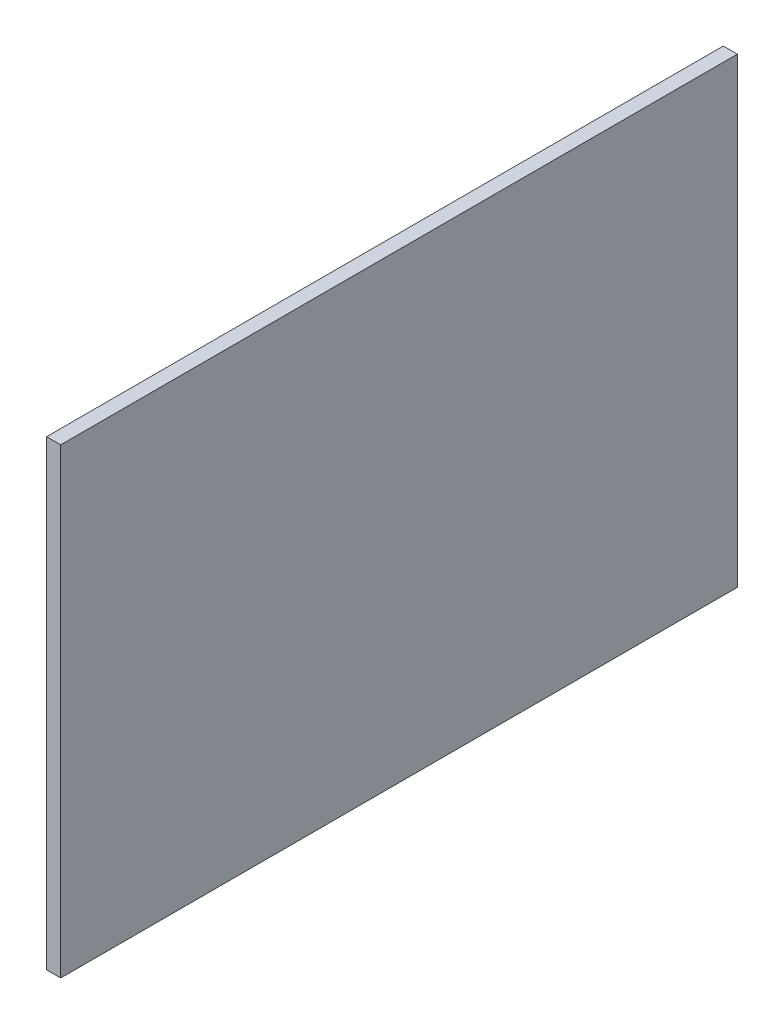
ISO-10303-21;
HEADER;
FILE_DESCRIPTION(('STEP AP214'),'2;1');
FILE_NAME('part.step','',(''),(''),'','','');
FILE_SCHEMA(('AUTOMOTIVE_DESIGN { 1 0 10303 214 1 1 1 1 }'));
ENDSEC;
DATA;
#1=APPLICATION_CONTEXT('core data for automotive mechanical design processes');
#2=APPLICATION_PROTOCOL_DEFINITION('international standard','automotive_design',2000,#1);
#3=PRODUCT_CONTEXT('',#1,'mechanical');
#4=PRODUCT('Part','Part','',(#3));
#5=PRODUCT_RELATED_PRODUCT_CATEGORY('part','',(#4));
#6=PRODUCT_DEFINITION_FORMATION('','',#4);
#7=PRODUCT_DEFINITION_CONTEXT('part definition',#1,'design');
#8=PRODUCT_DEFINITION('design','',#6,#7);
#9=PRODUCT_DEFINITION_SHAPE('','',#8);
#10=(LENGTH_UNIT() NAMED_UNIT(*) SI_UNIT(.MILLI.,.METRE.));
#11=(NAMED_UNIT(*) PLANE_ANGLE_UNIT() SI_UNIT($,.RADIAN.));
#12=(NAMED_UNIT(*) SI_UNIT($,.STERADIAN.) SOLID_ANGLE_UNIT());
#13=UNCERTAINTY_MEASURE_WITH_UNIT(LENGTH_MEASURE(1.E-05),#10,'distance_accuracy_value','');
#14=(GEOMETRIC_REPRESENTATION_CONTEXT(3) GLOBAL_UNCERTAINTY_ASSIGNED_CONTEXT((#13)) GLOBAL_UNIT_ASSIGNED_CONTEXT((#10,
#11,#12)) REPRESENTATION_CONTEXT('',''));
#15=CARTESIAN_POINT('',(0.,0.,0.));
#16=DIRECTION('',(0.,0.,1.));
#17=DIRECTION('',(1.,0.,0.));
#18=AXIS2_PLACEMENT_3D('',#15,#16,#17);
#19=CARTESIAN_POINT('',(0.,831.85,0.));
#20=DIRECTION('',(1.,0.,0.));
#21=DIRECTION('',(0.,0.,-1.));
#22=AXIS2_PLACEMENT_3D('',#19,#20,#21);
#23=PLANE('',#22);
#24=DIRECTION('',(0.,0.,1.));
#25=VECTOR('',#24,1.);
#26=CARTESIAN_POINT('',(0.,0.,0.));
#27=LINE('',#26,#25);
#28=CARTESIAN_POINT('',(0.,0.,-1219.2));
#29=VERTEX_POINT('',#28);
#30=CARTESIAN_POINT('',(0.,0.,0.));
#31=VERTEX_POINT('',#30);
#32=EDGE_CURVE('E95',#29,#31,#27,.T.);
#33=ORIENTED_EDGE('',*,*,#32,.T.);
#34=DIRECTION('',(0.,-1.,0.));
#35=VECTOR('',#34,1.);
#36=CARTESIAN_POINT('',(0.,831.85,0.));
#37=LINE('',#36,#35);
#38=CARTESIAN_POINT('',(0.,831.85,0.));
#39=VERTEX_POINT('',#38);
#40=EDGE_CURVE('E11',#39,#31,#37,.T.);
#41=ORIENTED_EDGE('',*,*,#40,.F.);
#42=DIRECTION('',(0.,0.,1.));
#43=VECTOR('',#42,1.);
#44=CARTESIAN_POINT('',(0.,831.85,0.));
#45=LINE('',#44,#43);
#46=CARTESIAN_POINT('',(0.,831.85,-1219.2));
#47=VERTEX_POINT('',#46);
#48=EDGE_CURVE('E83',#47,#39,#45,.T.);
#49=ORIENTED_EDGE('',*,*,#48,.F.);
#50=DIRECTION('',(0.,-1.,0.));
#51=VECTOR('',#50,1.);
#52=CARTESIAN_POINT('',(0.,831.85,-1219.2));
#53=LINE('',#52,#51);
#54=EDGE_CURVE('E91',#47,#29,#53,.T.);
#55=ORIENTED_EDGE('',*,*,#54,.T.);
#56=EDGE_LOOP('',(#33,#41,#49,#55));
#57=FACE_BOUND('',#56,.T.);
#58=ADVANCED_FACE('F32',(#57),#23,.F.);
#59=CARTESIAN_POINT('',(0.,831.85,0.));
#60=DIRECTION('',(0.,0.,-1.));
#61=DIRECTION('',(-1.,0.,0.));
#62=AXIS2_PLACEMENT_3D('',#59,#60,#61);
#63=PLANE('',#62);
#64=DIRECTION('',(1.,0.,0.));
#65=VECTOR('',#64,1.);
#66=CARTESIAN_POINT('',(0.,0.,0.));
#67=LINE('',#66,#65);
#68=CARTESIAN_POINT('',(25.4,0.,0.));
#69=VERTEX_POINT('',#68);
#70=EDGE_CURVE('E87',#31,#69,#67,.T.);
#71=ORIENTED_EDGE('',*,*,#70,.T.);
#72=DIRECTION('',(0.,-1.,0.));
#73=VECTOR('',#72,1.);
#74=CARTESIAN_POINT('',(25.4,831.85,0.));
#75=LINE('',#74,#73);
#76=CARTESIAN_POINT('',(25.4,831.85,0.));
#77=VERTEX_POINT('',#76);
#78=EDGE_CURVE('E40',#77,#69,#75,.T.);
#79=ORIENTED_EDGE('',*,*,#78,.F.);
#80=DIRECTION('',(1.,0.,0.));
#81=VECTOR('',#80,1.);
#82=CARTESIAN_POINT('',(0.,831.85,0.));
#83=LINE('',#82,#81);
#84=EDGE_CURVE('E78',#39,#77,#83,.T.);
#85=ORIENTED_EDGE('',*,*,#84,.F.);
#86=ORIENTED_EDGE('',*,*,#40,.T.);
#87=EDGE_LOOP('',(#71,#79,#85,#86));
#88=FACE_BOUND('',#87,.T.);
#89=ADVANCED_FACE('F86',(#88),#63,.F.);
#90=CARTESIAN_POINT('',(25.4,831.85,0.));
#91=DIRECTION('',(-1.,0.,0.));
#92=DIRECTION('',(0.,0.,1.));
#93=AXIS2_PLACEMENT_3D('',#90,#91,#92);
#94=PLANE('',#93);
#95=DIRECTION('',(0.,0.,-1.));
#96=VECTOR('',#95,1.);
#97=CARTESIAN_POINT('',(25.4,0.,0.));
#98=LINE('',#97,#96);
#99=CARTESIAN_POINT('',(25.4,0.,-1219.2));
#100=VERTEX_POINT('',#99);
#101=EDGE_CURVE('E65',#69,#100,#98,.T.);
#102=ORIENTED_EDGE('',*,*,#101,.T.);
#103=DIRECTION('',(0.,-1.,0.));
#104=VECTOR('',#103,1.);
#105=CARTESIAN_POINT('',(25.4,831.85,-1219.2));
#106=LINE('',#105,#104);
#107=CARTESIAN_POINT('',(25.4,831.85,-1219.2));
#108=VERTEX_POINT('',#107);
#109=EDGE_CURVE('E88',#108,#100,#106,.T.);
#110=ORIENTED_EDGE('',*,*,#109,.F.);
#111=DIRECTION('',(0.,0.,-1.));
#112=VECTOR('',#111,1.);
#113=CARTESIAN_POINT('',(25.4,831.85,0.));
#114=LINE('',#113,#112);
#115=EDGE_CURVE('E81',#77,#108,#114,.T.);
#116=ORIENTED_EDGE('',*,*,#115,.F.);
#117=ORIENTED_EDGE('',*,*,#78,.T.);
#118=EDGE_LOOP('',(#102,#110,#116,#117));
#119=FACE_BOUND('',#118,.T.);
#120=ADVANCED_FACE('F89',(#119),#94,.F.);
#121=CARTESIAN_POINT('',(0.,831.85,-1219.2));
#122=DIRECTION('',(0.,0.,1.));
#123=DIRECTION('',(1.,0.,0.));
#124=AXIS2_PLACEMENT_3D('',#121,#122,#123);
#125=PLANE('',#124);
#126=DIRECTION('',(-1.,0.,0.));
#127=VECTOR('',#126,1.);
#128=CARTESIAN_POINT('',(0.,0.,-1219.2));
#129=LINE('',#128,#127);
#130=EDGE_CURVE('E71',#100,#29,#129,.T.);
#131=ORIENTED_EDGE('',*,*,#130,.T.);
#132=ORIENTED_EDGE('',*,*,#54,.F.);
#133=DIRECTION('',(-1.,0.,0.));
#134=VECTOR('',#133,1.);
#135=CARTESIAN_POINT('',(0.,831.85,-1219.2));
#136=LINE('',#135,#134);
#137=EDGE_CURVE('E48',#108,#47,#136,.T.);
#138=ORIENTED_EDGE('',*,*,#137,.F.);
#139=ORIENTED_EDGE('',*,*,#109,.T.);
#140=EDGE_LOOP('',(#131,#132,#138,#139));
#141=FACE_BOUND('',#140,.T.);
#142=ADVANCED_FACE('F102',(#141),#125,.F.);
#143=CARTESIAN_POINT('',(0.,831.85,0.));
#144=DIRECTION('',(0.,-1.,0.));
#145=DIRECTION('',(0.,0.,-1.));
#146=AXIS2_PLACEMENT_3D('',#143,#144,#145);
#147=PLANE('',#146);
#148=ORIENTED_EDGE('',*,*,#48,.T.);
#149=ORIENTED_EDGE('',*,*,#84,.T.);
#150=ORIENTED_EDGE('',*,*,#115,.T.);
#151=ORIENTED_EDGE('',*,*,#137,.T.);
#152=EDGE_LOOP('',(#148,#149,#150,#151));
#153=FACE_BOUND('',#152,.T.);
#154=ADVANCED_FACE('F79',(#153),#147,.F.);
#155=CARTESIAN_POINT('',(0.,0.,0.));
#156=DIRECTION('',(0.,-1.,0.));
#157=DIRECTION('',(0.,0.,-1.));
#158=AXIS2_PLACEMENT_3D('',#155,#156,#157);
#159=PLANE('',#158);
#160=ORIENTED_EDGE('',*,*,#32,.F.);
#161=ORIENTED_EDGE('',*,*,#130,.F.);
#162=ORIENTED_EDGE('',*,*,#101,.F.);
#163=ORIENTED_EDGE('',*,*,#70,.F.);
#164=EDGE_LOOP('',(#160,#161,#162,#163));
#165=FACE_BOUND('',#164,.T.);
#166=ADVANCED_FACE('F105',(#165),#159,.T.);
#167=CLOSED_SHELL('',(#58,#89,#120,#142,#154,#166));
#168=MANIFOLD_SOLID_BREP('B2',#167);
#169=ADVANCED_BREP_SHAPE_REPRESENTATION('',(#18,#168),#14);
#170=SHAPE_DEFINITION_REPRESENTATION(#9,#169);
ENDSEC;
END-ISO-10303-21;
